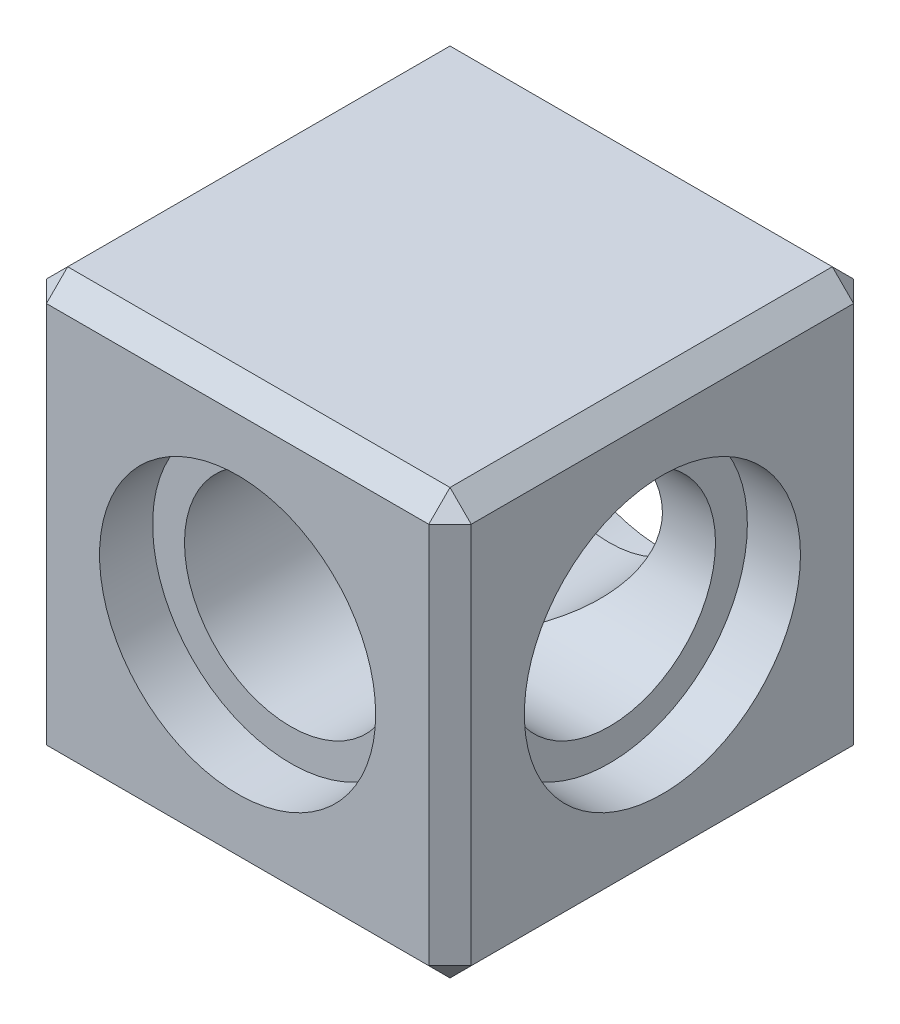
ISO-10303-21;
HEADER;
FILE_DESCRIPTION(('STEP AP214'),'2;1');
FILE_NAME('part.step','',(''),(''),'','','');
FILE_SCHEMA(('AUTOMOTIVE_DESIGN { 1 0 10303 214 1 1 1 1 }'));
ENDSEC;
DATA;
#1=APPLICATION_CONTEXT('core data for automotive mechanical design processes');
#2=APPLICATION_PROTOCOL_DEFINITION('international standard','automotive_design',2000,#1);
#3=PRODUCT_CONTEXT('',#1,'mechanical');
#4=PRODUCT('Part','Part','',(#3));
#5=PRODUCT_RELATED_PRODUCT_CATEGORY('part','',(#4));
#6=PRODUCT_DEFINITION_FORMATION('','',#4);
#7=PRODUCT_DEFINITION_CONTEXT('part definition',#1,'design');
#8=PRODUCT_DEFINITION('design','',#6,#7);
#9=PRODUCT_DEFINITION_SHAPE('','',#8);
#10=(LENGTH_UNIT() NAMED_UNIT(*) SI_UNIT(.MILLI.,.METRE.));
#11=(NAMED_UNIT(*) PLANE_ANGLE_UNIT() SI_UNIT($,.RADIAN.));
#12=(NAMED_UNIT(*) SI_UNIT($,.STERADIAN.) SOLID_ANGLE_UNIT());
#13=UNCERTAINTY_MEASURE_WITH_UNIT(LENGTH_MEASURE(1.E-05),#10,'distance_accuracy_value','');
#14=(GEOMETRIC_REPRESENTATION_CONTEXT(3) GLOBAL_UNCERTAINTY_ASSIGNED_CONTEXT((#13)) GLOBAL_UNIT_ASSIGNED_CONTEXT((#10,
#11,#12)) REPRESENTATION_CONTEXT('',''));
#15=CARTESIAN_POINT('',(0.,0.,0.));
#16=DIRECTION('',(0.,0.,1.));
#17=DIRECTION('',(1.,0.,0.));
#18=AXIS2_PLACEMENT_3D('',#15,#16,#17);
#19=CARTESIAN_POINT('',(-20.001,0.,0.));
#20=DIRECTION('',(1.,0.,0.));
#21=DIRECTION('',(0.,0.,-1.));
#22=AXIS2_PLACEMENT_3D('',#19,#20,#21);
#23=CYLINDRICAL_SURFACE('',#22,10.);
#24=CARTESIAN_POINT('',(0.,0.,0.));
#25=DIRECTION('',(0.707106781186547,0.,0.707106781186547));
#26=DIRECTION('',(0.707106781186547,0.,-0.707106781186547));
#27=AXIS2_PLACEMENT_3D('',#24,#25,#26);
#28=ELLIPSE('',#27,14.1421356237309,10.);
#29=CARTESIAN_POINT('',(0.,10.,0.));
#30=VERTEX_POINT('',#29);
#31=CARTESIAN_POINT('',(0.,-10.,0.));
#32=VERTEX_POINT('',#31);
#33=EDGE_CURVE('E131',#30,#32,#28,.F.);
#34=ORIENTED_EDGE('',*,*,#33,.T.);
#35=CARTESIAN_POINT('',(0.,0.,0.));
#36=DIRECTION('',(0.707106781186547,0.,-0.707106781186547));
#37=DIRECTION('',(0.707106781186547,0.,0.707106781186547));
#38=AXIS2_PLACEMENT_3D('',#35,#36,#37);
#39=ELLIPSE('',#38,14.1421356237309,10.);
#40=EDGE_CURVE('E128',#32,#30,#39,.F.);
#41=ORIENTED_EDGE('',*,*,#40,.T.);
#42=EDGE_LOOP('',(#34,#41));
#43=FACE_BOUND('',#42,.T.);
#44=CARTESIAN_POINT('',(15.,0.,0.));
#45=DIRECTION('',(1.,0.,0.));
#46=DIRECTION('',(0.,0.,-1.));
#47=AXIS2_PLACEMENT_3D('',#44,#45,#46);
#48=CIRCLE('',#47,10.);
#49=CARTESIAN_POINT('',(15.,0.,-10.));
#50=VERTEX_POINT('',#49);
#51=EDGE_CURVE('E152',#50,#50,#48,.F.);
#52=ORIENTED_EDGE('',*,*,#51,.F.);
#53=EDGE_LOOP('',(#52));
#54=FACE_BOUND('',#53,.T.);
#55=ADVANCED_FACE('F34',(#43,#54),#23,.F.);
#56=CARTESIAN_POINT('',(0.,0.,-20.));
#57=DIRECTION('',(0.,0.,1.));
#58=DIRECTION('',(1.,0.,0.));
#59=AXIS2_PLACEMENT_3D('',#56,#57,#58);
#60=CYLINDRICAL_SURFACE('',#59,10.);
#61=CARTESIAN_POINT('',(0.,0.,15.));
#62=DIRECTION('',(0.,0.,1.));
#63=DIRECTION('',(1.,0.,0.));
#64=AXIS2_PLACEMENT_3D('',#61,#62,#63);
#65=CIRCLE('',#64,10.);
#66=CARTESIAN_POINT('',(10.,0.,15.));
#67=VERTEX_POINT('',#66);
#68=EDGE_CURVE('E133',#67,#67,#65,.F.);
#69=ORIENTED_EDGE('',*,*,#68,.F.);
#70=EDGE_LOOP('',(#69));
#71=FACE_BOUND('',#70,.T.);
#72=ORIENTED_EDGE('',*,*,#40,.F.);
#73=ORIENTED_EDGE('',*,*,#33,.F.);
#74=EDGE_LOOP('',(#72,#73));
#75=FACE_BOUND('',#74,.T.);
#76=CARTESIAN_POINT('',(0.,0.,-15.));
#77=DIRECTION('',(0.,0.,-1.));
#78=DIRECTION('',(-1.,0.,0.));
#79=AXIS2_PLACEMENT_3D('',#76,#77,#78);
#80=CIRCLE('',#79,10.);
#81=CARTESIAN_POINT('',(-10.,0.,-15.));
#82=VERTEX_POINT('',#81);
#83=EDGE_CURVE('E148',#82,#82,#80,.F.);
#84=ORIENTED_EDGE('',*,*,#83,.F.);
#85=EDGE_LOOP('',(#84));
#86=FACE_BOUND('',#85,.T.);
#87=ADVANCED_FACE('F135',(#71,#75,#86),#60,.F.);
#88=CARTESIAN_POINT('',(-20.,-20.,20.));
#89=DIRECTION('',(1.,0.,0.));
#90=DIRECTION('',(0.,0.,-1.));
#91=AXIS2_PLACEMENT_3D('',#88,#89,#90);
#92=PLANE('',#91);
#93=DIRECTION('',(0.,-1.,0.));
#94=VECTOR('',#93,1.);
#95=CARTESIAN_POINT('',(-20.,-20.,-18.));
#96=LINE('',#95,#94);
#97=CARTESIAN_POINT('',(-20.,18.,-18.));
#98=VERTEX_POINT('',#97);
#99=CARTESIAN_POINT('',(-20.,-18.,-18.));
#100=VERTEX_POINT('',#99);
#101=EDGE_CURVE('E167',#98,#100,#96,.T.);
#102=ORIENTED_EDGE('',*,*,#101,.T.);
#103=DIRECTION('',(0.,0.,1.));
#104=VECTOR('',#103,1.);
#105=CARTESIAN_POINT('',(-20.,-18.,20.));
#106=LINE('',#105,#104);
#107=CARTESIAN_POINT('',(-20.,-18.,18.));
#108=VERTEX_POINT('',#107);
#109=EDGE_CURVE('E169',#100,#108,#106,.T.);
#110=ORIENTED_EDGE('',*,*,#109,.T.);
#111=DIRECTION('',(0.,1.,0.));
#112=VECTOR('',#111,1.);
#113=CARTESIAN_POINT('',(-20.,20.,18.));
#114=LINE('',#113,#112);
#115=CARTESIAN_POINT('',(-20.,18.,18.));
#116=VERTEX_POINT('',#115);
#117=EDGE_CURVE('E163',#108,#116,#114,.T.);
#118=ORIENTED_EDGE('',*,*,#117,.T.);
#119=DIRECTION('',(0.,0.,-1.));
#120=VECTOR('',#119,1.);
#121=CARTESIAN_POINT('',(-20.,18.,20.));
#122=LINE('',#121,#120);
#123=EDGE_CURVE('E165',#116,#98,#122,.T.);
#124=ORIENTED_EDGE('',*,*,#123,.T.);
#125=EDGE_LOOP('',(#102,#110,#118,#124));
#126=FACE_BOUND('',#125,.T.);
#127=ADVANCED_FACE('F313',(#126),#92,.F.);
#128=CARTESIAN_POINT('',(20.,-20.,20.));
#129=DIRECTION('',(0.,1.,0.));
#130=DIRECTION('',(-1.,0.,0.));
#131=AXIS2_PLACEMENT_3D('',#128,#129,#130);
#132=PLANE('',#131);
#133=DIRECTION('',(-1.,0.,0.));
#134=VECTOR('',#133,1.);
#135=CARTESIAN_POINT('',(-20.,-20.,18.));
#136=LINE('',#135,#134);
#137=CARTESIAN_POINT('',(18.,-20.,18.));
#138=VERTEX_POINT('',#137);
#139=CARTESIAN_POINT('',(-18.,-20.,18.));
#140=VERTEX_POINT('',#139);
#141=EDGE_CURVE('E158',#138,#140,#136,.T.);
#142=ORIENTED_EDGE('',*,*,#141,.T.);
#143=DIRECTION('',(0.,0.,-1.));
#144=VECTOR('',#143,1.);
#145=CARTESIAN_POINT('',(-18.,-20.,20.));
#146=LINE('',#145,#144);
#147=CARTESIAN_POINT('',(-18.,-20.,-18.));
#148=VERTEX_POINT('',#147);
#149=EDGE_CURVE('E160',#140,#148,#146,.T.);
#150=ORIENTED_EDGE('',*,*,#149,.T.);
#151=DIRECTION('',(1.,0.,0.));
#152=VECTOR('',#151,1.);
#153=CARTESIAN_POINT('',(20.,-20.,-18.));
#154=LINE('',#153,#152);
#155=CARTESIAN_POINT('',(18.,-20.,-18.));
#156=VERTEX_POINT('',#155);
#157=EDGE_CURVE('E137',#148,#156,#154,.T.);
#158=ORIENTED_EDGE('',*,*,#157,.T.);
#159=DIRECTION('',(0.,0.,1.));
#160=VECTOR('',#159,1.);
#161=CARTESIAN_POINT('',(18.,-20.,20.));
#162=LINE('',#161,#160);
#163=EDGE_CURVE('E139',#156,#138,#162,.T.);
#164=ORIENTED_EDGE('',*,*,#163,.T.);
#165=EDGE_LOOP('',(#142,#150,#158,#164));
#166=FACE_BOUND('',#165,.T.);
#167=ADVANCED_FACE('F596',(#166),#132,.F.);
#168=CARTESIAN_POINT('',(20.,-20.,20.));
#169=DIRECTION('',(-1.,0.,0.));
#170=DIRECTION('',(0.,0.,1.));
#171=AXIS2_PLACEMENT_3D('',#168,#169,#170);
#172=PLANE('',#171);
#173=DIRECTION('',(0.,0.,-1.));
#174=VECTOR('',#173,1.);
#175=CARTESIAN_POINT('',(20.,-18.,20.));
#176=LINE('',#175,#174);
#177=CARTESIAN_POINT('',(20.,-18.,18.));
#178=VERTEX_POINT('',#177);
#179=CARTESIAN_POINT('',(20.,-18.,-18.));
#180=VERTEX_POINT('',#179);
#181=EDGE_CURVE('E185',#178,#180,#176,.T.);
#182=ORIENTED_EDGE('',*,*,#181,.T.);
#183=DIRECTION('',(0.,1.,0.));
#184=VECTOR('',#183,1.);
#185=CARTESIAN_POINT('',(20.,-20.,-18.));
#186=LINE('',#185,#184);
#187=CARTESIAN_POINT('',(20.,18.,-18.));
#188=VERTEX_POINT('',#187);
#189=EDGE_CURVE('E188',#180,#188,#186,.T.);
#190=ORIENTED_EDGE('',*,*,#189,.T.);
#191=DIRECTION('',(0.,0.,1.));
#192=VECTOR('',#191,1.);
#193=CARTESIAN_POINT('',(20.,18.,20.));
#194=LINE('',#193,#192);
#195=CARTESIAN_POINT('',(20.,18.,18.));
#196=VERTEX_POINT('',#195);
#197=EDGE_CURVE('E183',#188,#196,#194,.T.);
#198=ORIENTED_EDGE('',*,*,#197,.T.);
#199=DIRECTION('',(0.,-1.,0.));
#200=VECTOR('',#199,1.);
#201=CARTESIAN_POINT('',(20.,-20.,18.));
#202=LINE('',#201,#200);
#203=EDGE_CURVE('E181',#196,#178,#202,.T.);
#204=ORIENTED_EDGE('',*,*,#203,.T.);
#205=EDGE_LOOP('',(#182,#190,#198,#204));
#206=FACE_BOUND('',#205,.T.);
#207=CARTESIAN_POINT('',(20.,0.,0.));
#208=DIRECTION('',(1.,0.,0.));
#209=DIRECTION('',(0.,0.,-1.));
#210=AXIS2_PLACEMENT_3D('',#207,#208,#209);
#211=CIRCLE('',#210,13.);
#212=CARTESIAN_POINT('',(20.,0.,-13.));
#213=VERTEX_POINT('',#212);
#214=EDGE_CURVE('E269',#213,#213,#211,.T.);
#215=ORIENTED_EDGE('',*,*,#214,.F.);
#216=EDGE_LOOP('',(#215));
#217=FACE_BOUND('',#216,.T.);
#218=ADVANCED_FACE('F305',(#206,#217),#172,.F.);
#219=CARTESIAN_POINT('',(20.,20.,20.));
#220=DIRECTION('',(0.,-1.,0.));
#221=DIRECTION('',(1.,0.,0.));
#222=AXIS2_PLACEMENT_3D('',#219,#220,#221);
#223=PLANE('',#222);
#224=DIRECTION('',(1.,0.,0.));
#225=VECTOR('',#224,1.);
#226=CARTESIAN_POINT('',(20.,20.,18.));
#227=LINE('',#226,#225);
#228=CARTESIAN_POINT('',(-18.,20.,18.));
#229=VERTEX_POINT('',#228);
#230=CARTESIAN_POINT('',(18.,20.,18.));
#231=VERTEX_POINT('',#230);
#232=EDGE_CURVE('E199',#229,#231,#227,.T.);
#233=ORIENTED_EDGE('',*,*,#232,.T.);
#234=DIRECTION('',(0.,0.,-1.));
#235=VECTOR('',#234,1.);
#236=CARTESIAN_POINT('',(18.,20.,20.));
#237=LINE('',#236,#235);
#238=CARTESIAN_POINT('',(18.,20.,-18.));
#239=VERTEX_POINT('',#238);
#240=EDGE_CURVE('E11',#231,#239,#237,.T.);
#241=ORIENTED_EDGE('',*,*,#240,.T.);
#242=DIRECTION('',(-1.,0.,0.));
#243=VECTOR('',#242,1.);
#244=CARTESIAN_POINT('',(20.,20.,-18.));
#245=LINE('',#244,#243);
#246=CARTESIAN_POINT('',(-18.,20.,-18.));
#247=VERTEX_POINT('',#246);
#248=EDGE_CURVE('E43',#239,#247,#245,.T.);
#249=ORIENTED_EDGE('',*,*,#248,.T.);
#250=DIRECTION('',(0.,0.,1.));
#251=VECTOR('',#250,1.);
#252=CARTESIAN_POINT('',(-18.,20.,20.));
#253=LINE('',#252,#251);
#254=EDGE_CURVE('E201',#247,#229,#253,.T.);
#255=ORIENTED_EDGE('',*,*,#254,.T.);
#256=EDGE_LOOP('',(#233,#241,#249,#255));
#257=FACE_BOUND('',#256,.T.);
#258=ADVANCED_FACE('F295',(#257),#223,.F.);
#259=CARTESIAN_POINT('',(0.,0.,20.));
#260=DIRECTION('',(0.,0.,1.));
#261=DIRECTION('',(1.,0.,0.));
#262=AXIS2_PLACEMENT_3D('',#259,#260,#261);
#263=PLANE('',#262);
#264=DIRECTION('',(0.,-1.,0.));
#265=VECTOR('',#264,1.);
#266=CARTESIAN_POINT('',(-18.,-20.,20.));
#267=LINE('',#266,#265);
#268=CARTESIAN_POINT('',(-18.,18.,20.));
#269=VERTEX_POINT('',#268);
#270=CARTESIAN_POINT('',(-18.,-18.,20.));
#271=VERTEX_POINT('',#270);
#272=EDGE_CURVE('E176',#269,#271,#267,.T.);
#273=ORIENTED_EDGE('',*,*,#272,.T.);
#274=DIRECTION('',(1.,0.,0.));
#275=VECTOR('',#274,1.);
#276=CARTESIAN_POINT('',(20.,-18.,20.));
#277=LINE('',#276,#275);
#278=CARTESIAN_POINT('',(18.,-18.,20.));
#279=VERTEX_POINT('',#278);
#280=EDGE_CURVE('E178',#271,#279,#277,.T.);
#281=ORIENTED_EDGE('',*,*,#280,.T.);
#282=DIRECTION('',(0.,1.,0.));
#283=VECTOR('',#282,1.);
#284=CARTESIAN_POINT('',(18.,20.,20.));
#285=LINE('',#284,#283);
#286=CARTESIAN_POINT('',(18.,18.,20.));
#287=VERTEX_POINT('',#286);
#288=EDGE_CURVE('E172',#279,#287,#285,.T.);
#289=ORIENTED_EDGE('',*,*,#288,.T.);
#290=DIRECTION('',(-1.,0.,0.));
#291=VECTOR('',#290,1.);
#292=CARTESIAN_POINT('',(-20.,18.,20.));
#293=LINE('',#292,#291);
#294=EDGE_CURVE('E174',#287,#269,#293,.T.);
#295=ORIENTED_EDGE('',*,*,#294,.T.);
#296=EDGE_LOOP('',(#273,#281,#289,#295));
#297=FACE_BOUND('',#296,.T.);
#298=CARTESIAN_POINT('',(0.,0.,20.));
#299=DIRECTION('',(0.,0.,1.));
#300=DIRECTION('',(1.,0.,0.));
#301=AXIS2_PLACEMENT_3D('',#298,#299,#300);
#302=CIRCLE('',#301,13.);
#303=CARTESIAN_POINT('',(13.,0.,20.));
#304=VERTEX_POINT('',#303);
#305=EDGE_CURVE('E142',#304,#304,#302,.T.);
#306=ORIENTED_EDGE('',*,*,#305,.F.);
#307=EDGE_LOOP('',(#306));
#308=FACE_BOUND('',#307,.T.);
#309=ADVANCED_FACE('F292',(#297,#308),#263,.T.);
#310=CARTESIAN_POINT('',(0.,0.,-20.));
#311=DIRECTION('',(0.,0.,1.));
#312=DIRECTION('',(1.,0.,0.));
#313=AXIS2_PLACEMENT_3D('',#310,#311,#312);
#314=PLANE('',#313);
#315=DIRECTION('',(0.,-1.,0.));
#316=VECTOR('',#315,1.);
#317=CARTESIAN_POINT('',(18.,0.,-20.));
#318=LINE('',#317,#316);
#319=CARTESIAN_POINT('',(18.,18.,-20.));
#320=VERTEX_POINT('',#319);
#321=CARTESIAN_POINT('',(18.,-18.,-20.));
#322=VERTEX_POINT('',#321);
#323=EDGE_CURVE('E194',#320,#322,#318,.T.);
#324=ORIENTED_EDGE('',*,*,#323,.T.);
#325=DIRECTION('',(-1.,0.,0.));
#326=VECTOR('',#325,1.);
#327=CARTESIAN_POINT('',(0.,-18.,-20.));
#328=LINE('',#327,#326);
#329=CARTESIAN_POINT('',(-18.,-18.,-20.));
#330=VERTEX_POINT('',#329);
#331=EDGE_CURVE('E196',#322,#330,#328,.T.);
#332=ORIENTED_EDGE('',*,*,#331,.T.);
#333=DIRECTION('',(0.,1.,0.));
#334=VECTOR('',#333,1.);
#335=CARTESIAN_POINT('',(-18.,0.,-20.));
#336=LINE('',#335,#334);
#337=CARTESIAN_POINT('',(-18.,18.,-20.));
#338=VERTEX_POINT('',#337);
#339=EDGE_CURVE('E190',#330,#338,#336,.T.);
#340=ORIENTED_EDGE('',*,*,#339,.T.);
#341=DIRECTION('',(1.,0.,0.));
#342=VECTOR('',#341,1.);
#343=CARTESIAN_POINT('',(0.,18.,-20.));
#344=LINE('',#343,#342);
#345=EDGE_CURVE('E192',#338,#320,#344,.T.);
#346=ORIENTED_EDGE('',*,*,#345,.T.);
#347=EDGE_LOOP('',(#324,#332,#340,#346));
#348=FACE_BOUND('',#347,.T.);
#349=CARTESIAN_POINT('',(0.,0.,-20.));
#350=DIRECTION('',(0.,0.,1.));
#351=DIRECTION('',(1.,0.,0.));
#352=AXIS2_PLACEMENT_3D('',#349,#350,#351);
#353=CIRCLE('',#352,13.);
#354=CARTESIAN_POINT('',(13.,0.,-20.));
#355=VERTEX_POINT('',#354);
#356=EDGE_CURVE('E154',#355,#355,#353,.T.);
#357=ORIENTED_EDGE('',*,*,#356,.T.);
#358=EDGE_LOOP('',(#357));
#359=FACE_BOUND('',#358,.T.);
#360=ADVANCED_FACE('F294',(#348,#359),#314,.F.);
#361=CARTESIAN_POINT('',(0.,0.,15.));
#362=DIRECTION('',(0.,0.,1.));
#363=DIRECTION('',(1.,0.,0.));
#364=AXIS2_PLACEMENT_3D('',#361,#362,#363);
#365=PLANE('',#364);
#366=CARTESIAN_POINT('',(0.,0.,15.));
#367=DIRECTION('',(0.,0.,1.));
#368=DIRECTION('',(1.,0.,0.));
#369=AXIS2_PLACEMENT_3D('',#366,#367,#368);
#370=CIRCLE('',#369,13.);
#371=CARTESIAN_POINT('',(13.,0.,15.));
#372=VERTEX_POINT('',#371);
#373=EDGE_CURVE('E147',#372,#372,#370,.T.);
#374=ORIENTED_EDGE('',*,*,#373,.T.);
#375=EDGE_LOOP('',(#374));
#376=FACE_BOUND('',#375,.T.);
#377=ORIENTED_EDGE('',*,*,#68,.T.);
#378=EDGE_LOOP('',(#377));
#379=FACE_BOUND('',#378,.T.);
#380=ADVANCED_FACE('F302',(#376,#379),#365,.T.);
#381=CARTESIAN_POINT('',(0.,0.,15.));
#382=DIRECTION('',(0.,0.,1.));
#383=DIRECTION('',(1.,0.,0.));
#384=AXIS2_PLACEMENT_3D('',#381,#382,#383);
#385=CYLINDRICAL_SURFACE('',#384,13.);
#386=ORIENTED_EDGE('',*,*,#373,.F.);
#387=EDGE_LOOP('',(#386));
#388=FACE_BOUND('',#387,.T.);
#389=ORIENTED_EDGE('',*,*,#305,.T.);
#390=EDGE_LOOP('',(#389));
#391=FACE_BOUND('',#390,.T.);
#392=ADVANCED_FACE('F290',(#388,#391),#385,.F.);
#393=CARTESIAN_POINT('',(0.,0.,-15.));
#394=DIRECTION('',(0.,0.,-1.));
#395=DIRECTION('',(1.,0.,0.));
#396=AXIS2_PLACEMENT_3D('',#393,#394,#395);
#397=PLANE('',#396);
#398=CARTESIAN_POINT('',(0.,0.,-15.));
#399=DIRECTION('',(0.,0.,1.));
#400=DIRECTION('',(1.,0.,0.));
#401=AXIS2_PLACEMENT_3D('',#398,#399,#400);
#402=CIRCLE('',#401,13.);
#403=CARTESIAN_POINT('',(13.,0.,-15.));
#404=VERTEX_POINT('',#403);
#405=EDGE_CURVE('E151',#404,#404,#402,.T.);
#406=ORIENTED_EDGE('',*,*,#405,.F.);
#407=EDGE_LOOP('',(#406));
#408=FACE_BOUND('',#407,.T.);
#409=ORIENTED_EDGE('',*,*,#83,.T.);
#410=EDGE_LOOP('',(#409));
#411=FACE_BOUND('',#410,.T.);
#412=ADVANCED_FACE('F318',(#408,#411),#397,.T.);
#413=CARTESIAN_POINT('',(0.,0.,-15.));
#414=DIRECTION('',(0.,0.,-1.));
#415=DIRECTION('',(-1.,0.,0.));
#416=AXIS2_PLACEMENT_3D('',#413,#414,#415);
#417=CYLINDRICAL_SURFACE('',#416,13.);
#418=ORIENTED_EDGE('',*,*,#405,.T.);
#419=EDGE_LOOP('',(#418));
#420=FACE_BOUND('',#419,.T.);
#421=ORIENTED_EDGE('',*,*,#356,.F.);
#422=EDGE_LOOP('',(#421));
#423=FACE_BOUND('',#422,.T.);
#424=ADVANCED_FACE('F322',(#420,#423),#417,.F.);
#425=CARTESIAN_POINT('',(15.,0.,0.));
#426=DIRECTION('',(1.,0.,0.));
#427=DIRECTION('',(0.,0.,-1.));
#428=AXIS2_PLACEMENT_3D('',#425,#426,#427);
#429=PLANE('',#428);
#430=CARTESIAN_POINT('',(15.,0.,0.));
#431=DIRECTION('',(1.,0.,0.));
#432=DIRECTION('',(0.,0.,-1.));
#433=AXIS2_PLACEMENT_3D('',#430,#431,#432);
#434=CIRCLE('',#433,13.);
#435=CARTESIAN_POINT('',(15.,0.,-13.));
#436=VERTEX_POINT('',#435);
#437=EDGE_CURVE('E155',#436,#436,#434,.T.);
#438=ORIENTED_EDGE('',*,*,#437,.T.);
#439=EDGE_LOOP('',(#438));
#440=FACE_BOUND('',#439,.T.);
#441=ORIENTED_EDGE('',*,*,#51,.T.);
#442=EDGE_LOOP('',(#441));
#443=FACE_BOUND('',#442,.T.);
#444=ADVANCED_FACE('F325',(#440,#443),#429,.T.);
#445=CARTESIAN_POINT('',(15.,0.,0.));
#446=DIRECTION('',(1.,0.,0.));
#447=DIRECTION('',(0.,0.,-1.));
#448=AXIS2_PLACEMENT_3D('',#445,#446,#447);
#449=CYLINDRICAL_SURFACE('',#448,13.);
#450=ORIENTED_EDGE('',*,*,#437,.F.);
#451=EDGE_LOOP('',(#450));
#452=FACE_BOUND('',#451,.T.);
#453=ORIENTED_EDGE('',*,*,#214,.T.);
#454=EDGE_LOOP('',(#453));
#455=FACE_BOUND('',#454,.T.);
#456=ADVANCED_FACE('F330',(#452,#455),#449,.F.);
#457=CARTESIAN_POINT('',(18.,20.,20.));
#458=DIRECTION('',(-0.70710678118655,-0.707106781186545,0.));
#459=DIRECTION('',(0.,0.,-1.));
#460=AXIS2_PLACEMENT_3D('',#457,#458,#459);
#461=PLANE('',#460);
#462=DIRECTION('',(0.707106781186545,-0.70710678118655,0.));
#463=VECTOR('',#462,1.);
#464=CARTESIAN_POINT('',(20.,18.,18.));
#465=LINE('',#464,#463);
#466=EDGE_CURVE('E38',#196,#231,#465,.F.);
#467=ORIENTED_EDGE('',*,*,#466,.F.);
#468=ORIENTED_EDGE('',*,*,#197,.F.);
#469=DIRECTION('',(-0.707106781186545,0.70710678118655,0.));
#470=VECTOR('',#469,1.);
#471=CARTESIAN_POINT('',(18.,20.,-18.));
#472=LINE('',#471,#470);
#473=EDGE_CURVE('E263',#239,#188,#472,.F.);
#474=ORIENTED_EDGE('',*,*,#473,.F.);
#475=ORIENTED_EDGE('',*,*,#240,.F.);
#476=EDGE_LOOP('',(#467,#468,#474,#475));
#477=FACE_BOUND('',#476,.T.);
#478=ADVANCED_FACE('F36',(#477),#461,.F.);
#479=CARTESIAN_POINT('',(20.,18.,18.));
#480=DIRECTION('',(0.57735026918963,0.577350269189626,0.577350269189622));
#481=DIRECTION('',(-0.707106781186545,0.70710678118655,0.));
#482=AXIS2_PLACEMENT_3D('',#479,#480,#481);
#483=PLANE('',#482);
#484=DIRECTION('',(0.707106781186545,0.,-0.70710678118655));
#485=VECTOR('',#484,1.);
#486=CARTESIAN_POINT('',(20.,18.,18.));
#487=LINE('',#486,#485);
#488=EDGE_CURVE('E258',#196,#287,#487,.F.);
#489=ORIENTED_EDGE('',*,*,#488,.F.);
#490=ORIENTED_EDGE('',*,*,#466,.T.);
#491=DIRECTION('',(0.,-0.707106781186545,0.70710678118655));
#492=VECTOR('',#491,1.);
#493=CARTESIAN_POINT('',(18.,19.,19.));
#494=LINE('',#493,#492);
#495=EDGE_CURVE('E261',#287,#231,#494,.F.);
#496=ORIENTED_EDGE('',*,*,#495,.F.);
#497=EDGE_LOOP('',(#489,#490,#496));
#498=FACE_BOUND('',#497,.T.);
#499=ADVANCED_FACE('F354',(#498),#483,.T.);
#500=CARTESIAN_POINT('',(18.,20.,-18.));
#501=DIRECTION('',(0.57735026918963,0.577350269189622,-0.577350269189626));
#502=DIRECTION('',(-0.707106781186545,0.,-0.70710678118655));
#503=AXIS2_PLACEMENT_3D('',#500,#501,#502);
#504=PLANE('',#503);
#505=DIRECTION('',(0.,-0.70710678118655,-0.707106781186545));
#506=VECTOR('',#505,1.);
#507=CARTESIAN_POINT('',(18.,20.,-18.));
#508=LINE('',#507,#506);
#509=EDGE_CURVE('E253',#239,#320,#508,.T.);
#510=ORIENTED_EDGE('',*,*,#509,.F.);
#511=ORIENTED_EDGE('',*,*,#473,.T.);
#512=DIRECTION('',(0.707106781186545,0.,0.70710678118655));
#513=VECTOR('',#512,1.);
#514=CARTESIAN_POINT('',(19.,18.,-19.));
#515=LINE('',#514,#513);
#516=EDGE_CURVE('E255',#320,#188,#515,.T.);
#517=ORIENTED_EDGE('',*,*,#516,.F.);
#518=EDGE_LOOP('',(#510,#511,#517));
#519=FACE_BOUND('',#518,.T.);
#520=ADVANCED_FACE('F362',(#519),#504,.T.);
#521=CARTESIAN_POINT('',(0.,18.,20.));
#522=DIRECTION('',(0.,0.70710678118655,0.707106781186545));
#523=DIRECTION('',(1.,0.,0.));
#524=AXIS2_PLACEMENT_3D('',#521,#522,#523);
#525=PLANE('',#524);
#526=ORIENTED_EDGE('',*,*,#495,.T.);
#527=ORIENTED_EDGE('',*,*,#232,.F.);
#528=DIRECTION('',(0.,0.707106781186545,-0.70710678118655));
#529=VECTOR('',#528,1.);
#530=CARTESIAN_POINT('',(-18.,20.,18.));
#531=LINE('',#530,#529);
#532=EDGE_CURVE('E247',#269,#229,#531,.T.);
#533=ORIENTED_EDGE('',*,*,#532,.F.);
#534=ORIENTED_EDGE('',*,*,#294,.F.);
#535=EDGE_LOOP('',(#526,#527,#533,#534));
#536=FACE_BOUND('',#535,.T.);
#537=ADVANCED_FACE('F368',(#536),#525,.T.);
#538=CARTESIAN_POINT('',(18.,0.,20.));
#539=DIRECTION('',(0.70710678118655,0.,0.707106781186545));
#540=DIRECTION('',(0.,-1.,0.));
#541=AXIS2_PLACEMENT_3D('',#538,#539,#540);
#542=PLANE('',#541);
#543=ORIENTED_EDGE('',*,*,#488,.T.);
#544=ORIENTED_EDGE('',*,*,#288,.F.);
#545=DIRECTION('',(-0.707106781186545,0.,0.70710678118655));
#546=VECTOR('',#545,1.);
#547=CARTESIAN_POINT('',(18.,-18.,20.));
#548=LINE('',#547,#546);
#549=EDGE_CURVE('E244',#178,#279,#548,.T.);
#550=ORIENTED_EDGE('',*,*,#549,.F.);
#551=ORIENTED_EDGE('',*,*,#203,.F.);
#552=EDGE_LOOP('',(#543,#544,#550,#551));
#553=FACE_BOUND('',#552,.T.);
#554=ADVANCED_FACE('F375',(#553),#542,.T.);
#555=CARTESIAN_POINT('',(20.,-18.,20.));
#556=DIRECTION('',(-0.70710678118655,0.707106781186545,0.));
#557=DIRECTION('',(0.,0.,-1.));
#558=AXIS2_PLACEMENT_3D('',#555,#556,#557);
#559=PLANE('',#558);
#560=DIRECTION('',(0.707106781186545,0.70710678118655,0.));
#561=VECTOR('',#560,1.);
#562=CARTESIAN_POINT('',(20.,-18.,-18.));
#563=LINE('',#562,#561);
#564=EDGE_CURVE('E238',#180,#156,#563,.F.);
#565=ORIENTED_EDGE('',*,*,#564,.F.);
#566=ORIENTED_EDGE('',*,*,#181,.F.);
#567=DIRECTION('',(-0.707106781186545,-0.70710678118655,0.));
#568=VECTOR('',#567,1.);
#569=CARTESIAN_POINT('',(19.,-19.,18.));
#570=LINE('',#569,#568);
#571=EDGE_CURVE('E241',#138,#178,#570,.F.);
#572=ORIENTED_EDGE('',*,*,#571,.F.);
#573=ORIENTED_EDGE('',*,*,#163,.F.);
#574=EDGE_LOOP('',(#565,#566,#572,#573));
#575=FACE_BOUND('',#574,.T.);
#576=ADVANCED_FACE('F383',(#575),#559,.F.);
#577=CARTESIAN_POINT('',(20.,-20.,-18.));
#578=DIRECTION('',(-0.70710678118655,0.,0.707106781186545));
#579=DIRECTION('',(0.,1.,0.));
#580=AXIS2_PLACEMENT_3D('',#577,#578,#579);
#581=PLANE('',#580);
#582=ORIENTED_EDGE('',*,*,#516,.T.);
#583=ORIENTED_EDGE('',*,*,#189,.F.);
#584=DIRECTION('',(-0.707106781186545,0.,-0.70710678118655));
#585=VECTOR('',#584,1.);
#586=CARTESIAN_POINT('',(20.,-18.,-18.));
#587=LINE('',#586,#585);
#588=EDGE_CURVE('E236',#322,#180,#587,.F.);
#589=ORIENTED_EDGE('',*,*,#588,.F.);
#590=ORIENTED_EDGE('',*,*,#323,.F.);
#591=EDGE_LOOP('',(#582,#583,#589,#590));
#592=FACE_BOUND('',#591,.T.);
#593=ADVANCED_FACE('F391',(#592),#581,.F.);
#594=CARTESIAN_POINT('',(20.,20.,-18.));
#595=DIRECTION('',(0.,-0.707106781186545,0.70710678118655));
#596=DIRECTION('',(-1.,0.,0.));
#597=AXIS2_PLACEMENT_3D('',#594,#595,#596);
#598=PLANE('',#597);
#599=ORIENTED_EDGE('',*,*,#509,.T.);
#600=ORIENTED_EDGE('',*,*,#345,.F.);
#601=DIRECTION('',(0.,0.70710678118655,0.707106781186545));
#602=VECTOR('',#601,1.);
#603=CARTESIAN_POINT('',(-18.,20.,-18.));
#604=LINE('',#603,#602);
#605=EDGE_CURVE('E233',#247,#338,#604,.F.);
#606=ORIENTED_EDGE('',*,*,#605,.F.);
#607=ORIENTED_EDGE('',*,*,#248,.F.);
#608=EDGE_LOOP('',(#599,#600,#606,#607));
#609=FACE_BOUND('',#608,.T.);
#610=ADVANCED_FACE('F399',(#609),#598,.F.);
#611=CARTESIAN_POINT('',(-20.,18.,20.));
#612=DIRECTION('',(0.707106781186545,-0.70710678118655,0.));
#613=DIRECTION('',(0.,0.,-1.));
#614=AXIS2_PLACEMENT_3D('',#611,#612,#613);
#615=PLANE('',#614);
#616=DIRECTION('',(0.70710678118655,0.707106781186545,0.));
#617=VECTOR('',#616,1.);
#618=CARTESIAN_POINT('',(-18.,20.,18.));
#619=LINE('',#618,#617);
#620=EDGE_CURVE('E250',#229,#116,#619,.F.);
#621=ORIENTED_EDGE('',*,*,#620,.F.);
#622=ORIENTED_EDGE('',*,*,#254,.F.);
#623=DIRECTION('',(-0.70710678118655,-0.707106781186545,0.));
#624=VECTOR('',#623,1.);
#625=CARTESIAN_POINT('',(-18.,20.,-18.));
#626=LINE('',#625,#624);
#627=EDGE_CURVE('E230',#98,#247,#626,.F.);
#628=ORIENTED_EDGE('',*,*,#627,.F.);
#629=ORIENTED_EDGE('',*,*,#123,.F.);
#630=EDGE_LOOP('',(#621,#622,#628,#629));
#631=FACE_BOUND('',#630,.T.);
#632=ADVANCED_FACE('F407',(#631),#615,.F.);
#633=CARTESIAN_POINT('',(-18.,20.,18.));
#634=DIRECTION('',(-0.577350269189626,0.57735026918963,0.577350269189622));
#635=DIRECTION('',(-0.70710678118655,-0.707106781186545,0.));
#636=AXIS2_PLACEMENT_3D('',#633,#634,#635);
#637=PLANE('',#636);
#638=ORIENTED_EDGE('',*,*,#532,.T.);
#639=ORIENTED_EDGE('',*,*,#620,.T.);
#640=DIRECTION('',(0.707106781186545,0.,0.70710678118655));
#641=VECTOR('',#640,1.);
#642=CARTESIAN_POINT('',(-19.,18.,19.));
#643=LINE('',#642,#641);
#644=EDGE_CURVE('E227',#269,#116,#643,.F.);
#645=ORIENTED_EDGE('',*,*,#644,.F.);
#646=EDGE_LOOP('',(#638,#639,#645));
#647=FACE_BOUND('',#646,.T.);
#648=ADVANCED_FACE('F414',(#647),#637,.T.);
#649=CARTESIAN_POINT('',(18.,-18.,20.));
#650=DIRECTION('',(0.57735026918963,-0.577350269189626,0.577350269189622));
#651=DIRECTION('',(0.707106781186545,0.70710678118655,0.));
#652=AXIS2_PLACEMENT_3D('',#649,#650,#651);
#653=PLANE('',#652);
#654=ORIENTED_EDGE('',*,*,#571,.T.);
#655=ORIENTED_EDGE('',*,*,#549,.T.);
#656=DIRECTION('',(0.,-0.707106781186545,-0.70710678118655));
#657=VECTOR('',#656,1.);
#658=CARTESIAN_POINT('',(18.,-18.,20.));
#659=LINE('',#658,#657);
#660=EDGE_CURVE('E225',#138,#279,#659,.F.);
#661=ORIENTED_EDGE('',*,*,#660,.F.);
#662=EDGE_LOOP('',(#654,#655,#661));
#663=FACE_BOUND('',#662,.T.);
#664=ADVANCED_FACE('F422',(#663),#653,.T.);
#665=CARTESIAN_POINT('',(20.,-18.,-18.));
#666=DIRECTION('',(0.57735026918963,-0.577350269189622,-0.577350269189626));
#667=DIRECTION('',(-0.707106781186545,0.,-0.70710678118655));
#668=AXIS2_PLACEMENT_3D('',#665,#666,#667);
#669=PLANE('',#668);
#670=ORIENTED_EDGE('',*,*,#588,.T.);
#671=ORIENTED_EDGE('',*,*,#564,.T.);
#672=DIRECTION('',(0.,-0.70710678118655,0.707106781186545));
#673=VECTOR('',#672,1.);
#674=CARTESIAN_POINT('',(18.,-19.,-19.));
#675=LINE('',#674,#673);
#676=EDGE_CURVE('E222',#322,#156,#675,.T.);
#677=ORIENTED_EDGE('',*,*,#676,.F.);
#678=EDGE_LOOP('',(#670,#671,#677));
#679=FACE_BOUND('',#678,.T.);
#680=ADVANCED_FACE('F430',(#679),#669,.T.);
#681=CARTESIAN_POINT('',(-18.,20.,-18.));
#682=DIRECTION('',(-0.577350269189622,0.577350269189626,-0.57735026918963));
#683=DIRECTION('',(0.,0.70710678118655,0.707106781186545));
#684=AXIS2_PLACEMENT_3D('',#681,#682,#683);
#685=PLANE('',#684);
#686=ORIENTED_EDGE('',*,*,#627,.T.);
#687=ORIENTED_EDGE('',*,*,#605,.T.);
#688=DIRECTION('',(0.70710678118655,0.,-0.707106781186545));
#689=VECTOR('',#688,1.);
#690=CARTESIAN_POINT('',(-19.,18.,-19.));
#691=LINE('',#690,#689);
#692=EDGE_CURVE('E219',#98,#338,#691,.T.);
#693=ORIENTED_EDGE('',*,*,#692,.F.);
#694=EDGE_LOOP('',(#686,#687,#693));
#695=FACE_BOUND('',#694,.T.);
#696=ADVANCED_FACE('F438',(#695),#685,.T.);
#697=CARTESIAN_POINT('',(-18.,0.,20.));
#698=DIRECTION('',(-0.70710678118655,0.,0.707106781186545));
#699=DIRECTION('',(0.,1.,0.));
#700=AXIS2_PLACEMENT_3D('',#697,#698,#699);
#701=PLANE('',#700);
#702=ORIENTED_EDGE('',*,*,#644,.T.);
#703=ORIENTED_EDGE('',*,*,#117,.F.);
#704=DIRECTION('',(-0.707106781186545,0.,-0.70710678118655));
#705=VECTOR('',#704,1.);
#706=CARTESIAN_POINT('',(-20.,-18.,18.));
#707=LINE('',#706,#705);
#708=EDGE_CURVE('E216',#271,#108,#707,.T.);
#709=ORIENTED_EDGE('',*,*,#708,.F.);
#710=ORIENTED_EDGE('',*,*,#272,.F.);
#711=EDGE_LOOP('',(#702,#703,#709,#710));
#712=FACE_BOUND('',#711,.T.);
#713=ADVANCED_FACE('F446',(#712),#701,.T.);
#714=CARTESIAN_POINT('',(0.,-18.,20.));
#715=DIRECTION('',(0.,-0.70710678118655,0.707106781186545));
#716=DIRECTION('',(-1.,0.,0.));
#717=AXIS2_PLACEMENT_3D('',#714,#715,#716);
#718=PLANE('',#717);
#719=ORIENTED_EDGE('',*,*,#660,.T.);
#720=ORIENTED_EDGE('',*,*,#280,.F.);
#721=DIRECTION('',(0.,0.707106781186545,0.70710678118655));
#722=VECTOR('',#721,1.);
#723=CARTESIAN_POINT('',(-18.,-19.,19.));
#724=LINE('',#723,#722);
#725=EDGE_CURVE('E213',#140,#271,#724,.T.);
#726=ORIENTED_EDGE('',*,*,#725,.F.);
#727=ORIENTED_EDGE('',*,*,#141,.F.);
#728=EDGE_LOOP('',(#719,#720,#726,#727));
#729=FACE_BOUND('',#728,.T.);
#730=ADVANCED_FACE('F454',(#729),#718,.T.);
#731=CARTESIAN_POINT('',(20.,-20.,-18.));
#732=DIRECTION('',(0.,0.707106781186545,0.70710678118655));
#733=DIRECTION('',(1.,0.,0.));
#734=AXIS2_PLACEMENT_3D('',#731,#732,#733);
#735=PLANE('',#734);
#736=ORIENTED_EDGE('',*,*,#676,.T.);
#737=ORIENTED_EDGE('',*,*,#157,.F.);
#738=DIRECTION('',(0.,0.70710678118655,-0.707106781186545));
#739=VECTOR('',#738,1.);
#740=CARTESIAN_POINT('',(-18.,-20.,-18.));
#741=LINE('',#740,#739);
#742=EDGE_CURVE('E210',#330,#148,#741,.F.);
#743=ORIENTED_EDGE('',*,*,#742,.F.);
#744=ORIENTED_EDGE('',*,*,#331,.F.);
#745=EDGE_LOOP('',(#736,#737,#743,#744));
#746=FACE_BOUND('',#745,.T.);
#747=ADVANCED_FACE('F462',(#746),#735,.F.);
#748=CARTESIAN_POINT('',(-20.,-20.,-18.));
#749=DIRECTION('',(0.707106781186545,0.,0.70710678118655));
#750=DIRECTION('',(0.,-1.,0.));
#751=AXIS2_PLACEMENT_3D('',#748,#749,#750);
#752=PLANE('',#751);
#753=ORIENTED_EDGE('',*,*,#692,.T.);
#754=ORIENTED_EDGE('',*,*,#339,.F.);
#755=DIRECTION('',(-0.70710678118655,0.,0.707106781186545));
#756=VECTOR('',#755,1.);
#757=CARTESIAN_POINT('',(-19.,-18.,-19.));
#758=LINE('',#757,#756);
#759=EDGE_CURVE('E208',#100,#330,#758,.F.);
#760=ORIENTED_EDGE('',*,*,#759,.F.);
#761=ORIENTED_EDGE('',*,*,#101,.F.);
#762=EDGE_LOOP('',(#753,#754,#760,#761));
#763=FACE_BOUND('',#762,.T.);
#764=ADVANCED_FACE('F470',(#763),#752,.F.);
#765=CARTESIAN_POINT('',(-20.,-18.,18.));
#766=DIRECTION('',(-0.57735026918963,-0.577350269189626,0.577350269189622));
#767=DIRECTION('',(0.707106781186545,-0.70710678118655,0.));
#768=AXIS2_PLACEMENT_3D('',#765,#766,#767);
#769=PLANE('',#768);
#770=ORIENTED_EDGE('',*,*,#725,.T.);
#771=ORIENTED_EDGE('',*,*,#708,.T.);
#772=DIRECTION('',(-0.707106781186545,0.70710678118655,0.));
#773=VECTOR('',#772,1.);
#774=CARTESIAN_POINT('',(-20.,-18.,18.));
#775=LINE('',#774,#773);
#776=EDGE_CURVE('E206',#140,#108,#775,.T.);
#777=ORIENTED_EDGE('',*,*,#776,.F.);
#778=EDGE_LOOP('',(#770,#771,#777));
#779=FACE_BOUND('',#778,.T.);
#780=ADVANCED_FACE('F478',(#779),#769,.T.);
#781=CARTESIAN_POINT('',(-18.,-20.,-18.));
#782=DIRECTION('',(-0.577350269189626,-0.577350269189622,-0.57735026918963));
#783=DIRECTION('',(-0.70710678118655,0.,0.707106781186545));
#784=AXIS2_PLACEMENT_3D('',#781,#782,#783);
#785=PLANE('',#784);
#786=ORIENTED_EDGE('',*,*,#759,.T.);
#787=ORIENTED_EDGE('',*,*,#742,.T.);
#788=DIRECTION('',(0.707106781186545,-0.70710678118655,0.));
#789=VECTOR('',#788,1.);
#790=CARTESIAN_POINT('',(-18.,-20.,-18.));
#791=LINE('',#790,#789);
#792=EDGE_CURVE('E204',#100,#148,#791,.T.);
#793=ORIENTED_EDGE('',*,*,#792,.F.);
#794=EDGE_LOOP('',(#786,#787,#793));
#795=FACE_BOUND('',#794,.T.);
#796=ADVANCED_FACE('F486',(#795),#785,.T.);
#797=CARTESIAN_POINT('',(-18.,-20.,20.));
#798=DIRECTION('',(0.70710678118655,0.707106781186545,0.));
#799=DIRECTION('',(0.,0.,-1.));
#800=AXIS2_PLACEMENT_3D('',#797,#798,#799);
#801=PLANE('',#800);
#802=ORIENTED_EDGE('',*,*,#776,.T.);
#803=ORIENTED_EDGE('',*,*,#109,.F.);
#804=ORIENTED_EDGE('',*,*,#792,.T.);
#805=ORIENTED_EDGE('',*,*,#149,.F.);
#806=EDGE_LOOP('',(#802,#803,#804,#805));
#807=FACE_BOUND('',#806,.T.);
#808=ADVANCED_FACE('F494',(#807),#801,.F.);
#809=CLOSED_SHELL('',(#55,#87,#127,#167,#218,#258,#309,#360,#380,#392,#412,#424,#444,#456,#478,
#499,#520,#537,#554,#576,#593,#610,#632,#648,#664,#680,#696,#713,#730,#747,#764,#780,#796,#808));
#810=MANIFOLD_SOLID_BREP('B2',#809);
#811=ADVANCED_BREP_SHAPE_REPRESENTATION('',(#18,#810),#14);
#812=SHAPE_DEFINITION_REPRESENTATION(#9,#811);
ENDSEC;
END-ISO-10303-21;
